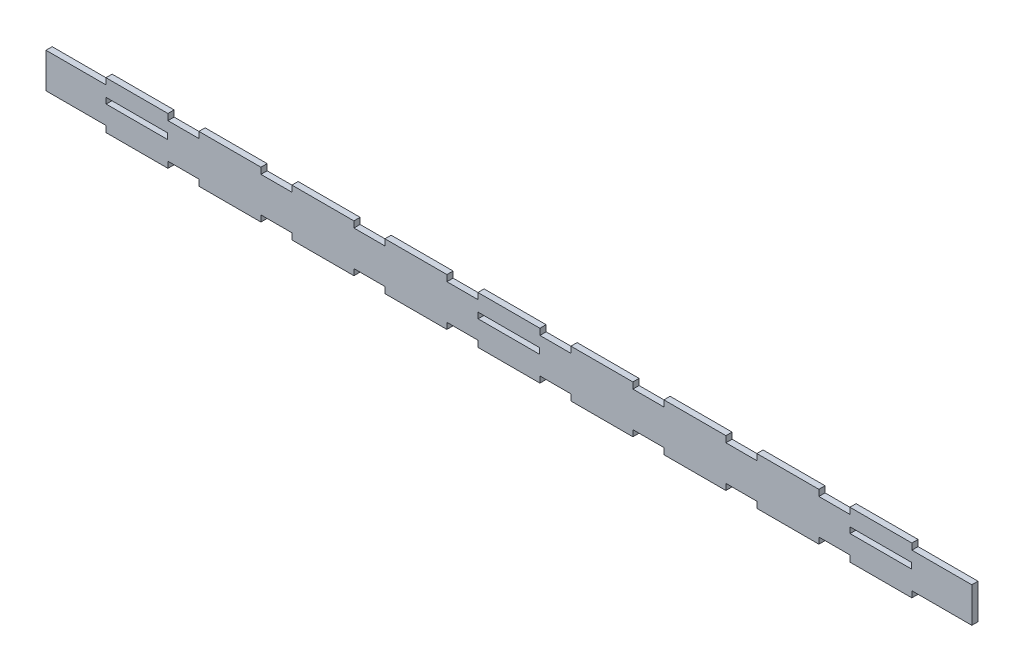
from build123d import *

# Parameters (mm, degrees)
CROQUIS1_W              = 448
CROQUIS1_H              = 17
SALIENTE_EXTRUIR1_DEPTH = 3
CROQUIS2_W              = 30
CROQUIS2_H              = 3
SALIENTE_EXTRUIR2_DEPTH = 3
CROQUIS4_W              = 30
CROQUIS4_H              = 3
SALIENTE_EXTRUIR3_DEPTH = 3
CORTAR_EXTRUIR1_REACH   = 226.315
CROQUIS5_W              = 29.8
CROQUIS5_H              = 2.8


with BuildPart() as part:
    # Croquis1 → Saliente-Extruir1 (new body)
    with BuildSketch(Plane.XY):
        Rectangle(CROQUIS1_W, CROQUIS1_H)
    extrude(amount=SALIENTE_EXTRUIR1_DEPTH)

    # Croquis2 → Saliente-Extruir2 (add)
    with BuildSketch(Plane(origin=(0, 8.5, 0), x_dir=(1, 0, 0), z_dir=(0, 1, 0))):
        with Locations((0, -1.5)):
            Rectangle(CROQUIS2_W, CROQUIS2_H)
        with Locations((-45, -1.5)):
            Rectangle(CROQUIS2_W, CROQUIS2_H)
        with Locations((-90, -1.5)):
            Rectangle(CROQUIS2_W, CROQUIS2_H)
        with Locations((-135, -1.5)):
            Rectangle(CROQUIS2_W, CROQUIS2_H)
        with Locations((135, -1.5)):
            Rectangle(CROQUIS2_W, CROQUIS2_H)
        with Locations((90, -1.5)):
            Rectangle(CROQUIS2_W, CROQUIS2_H)
        with Locations((45, -1.5)):
            Rectangle(CROQUIS2_W, CROQUIS2_H)
        with Locations((180, -1.5)):
            Rectangle(CROQUIS2_W, CROQUIS2_H)
        with Locations((-180, -1.5)):
            Rectangle(CROQUIS2_W, CROQUIS2_H)
    extrude(amount=SALIENTE_EXTRUIR2_DEPTH)

    # Croquis4 → Saliente-Extruir3 (add)
    with BuildSketch(Plane.XZ.offset(8.5)):
        with Locations((0, 1.5)):
            Rectangle(CROQUIS4_W, CROQUIS4_H)
        with Locations((45, 1.5)):
            Rectangle(CROQUIS4_W, CROQUIS4_H)
        with Locations((90, 1.5)):
            Rectangle(CROQUIS4_W, CROQUIS4_H)
        with Locations((135, 1.5)):
            Rectangle(CROQUIS4_W, CROQUIS4_H)
        with Locations((-135, 1.5)):
            Rectangle(CROQUIS4_W, CROQUIS4_H)
        with Locations((-90, 1.5)):
            Rectangle(CROQUIS4_W, CROQUIS4_H)
        with Locations((-45, 1.5)):
            Rectangle(CROQUIS4_W, CROQUIS4_H)
        with Locations((-180, 1.5)):
            Rectangle(CROQUIS4_W, CROQUIS4_H)
        with Locations((180, 1.5)):
            Rectangle(CROQUIS4_W, CROQUIS4_H)
    extrude(amount=SALIENTE_EXTRUIR3_DEPTH)

    # Croquis5 → Cortar-Extruir1 (cut, up to next)
    with BuildSketch(Plane(origin=(0, 0, 0), x_dir=(-1, 0, 0), z_dir=(0, 0, -1)), mode=Mode.PRIVATE) as cortar_extruir1_sk1:
        with Locations((-180, 1.9)):
            Rectangle(CROQUIS5_W, CROQUIS5_H)
    cortar_extruir1_tool1 = extrude(cortar_extruir1_sk1.sketch, amount=-CORTAR_EXTRUIR1_REACH, mode=Mode.PRIVATE) & part.part
    # Croquis5 → Cortar-Extruir1 (cut, up to next)
    with BuildSketch(Plane(origin=(0, 0, 0), x_dir=(-1, 0, 0), z_dir=(0, 0, -1)), mode=Mode.PRIVATE) as cortar_extruir1_sk2:
        with Locations((0, 1.9)):
            Rectangle(CROQUIS5_W, CROQUIS5_H)
    cortar_extruir1_tool2 = extrude(cortar_extruir1_sk2.sketch, amount=-CORTAR_EXTRUIR1_REACH, mode=Mode.PRIVATE) & part.part
    # Croquis5 → Cortar-Extruir1 (cut, up to next)
    with BuildSketch(Plane(origin=(0, 0, 0), x_dir=(-1, 0, 0), z_dir=(0, 0, -1)), mode=Mode.PRIVATE) as cortar_extruir1_sk3:
        with Locations((180, 1.9)):
            Rectangle(CROQUIS5_W, CROQUIS5_H)
    cortar_extruir1_tool3 = extrude(cortar_extruir1_sk3.sketch, amount=-CORTAR_EXTRUIR1_REACH, mode=Mode.PRIVATE) & part.part
    add(cortar_extruir1_tool1.solids().sort_by_distance((180, 1.9, 0))[0], mode=Mode.SUBTRACT)
    add(cortar_extruir1_tool2.solids().sort_by_distance((0, 1.9, 0))[0], mode=Mode.SUBTRACT)
    add(cortar_extruir1_tool3.solids().sort_by_distance((-180, 1.9, 0))[0], mode=Mode.SUBTRACT)


solid = part.part
